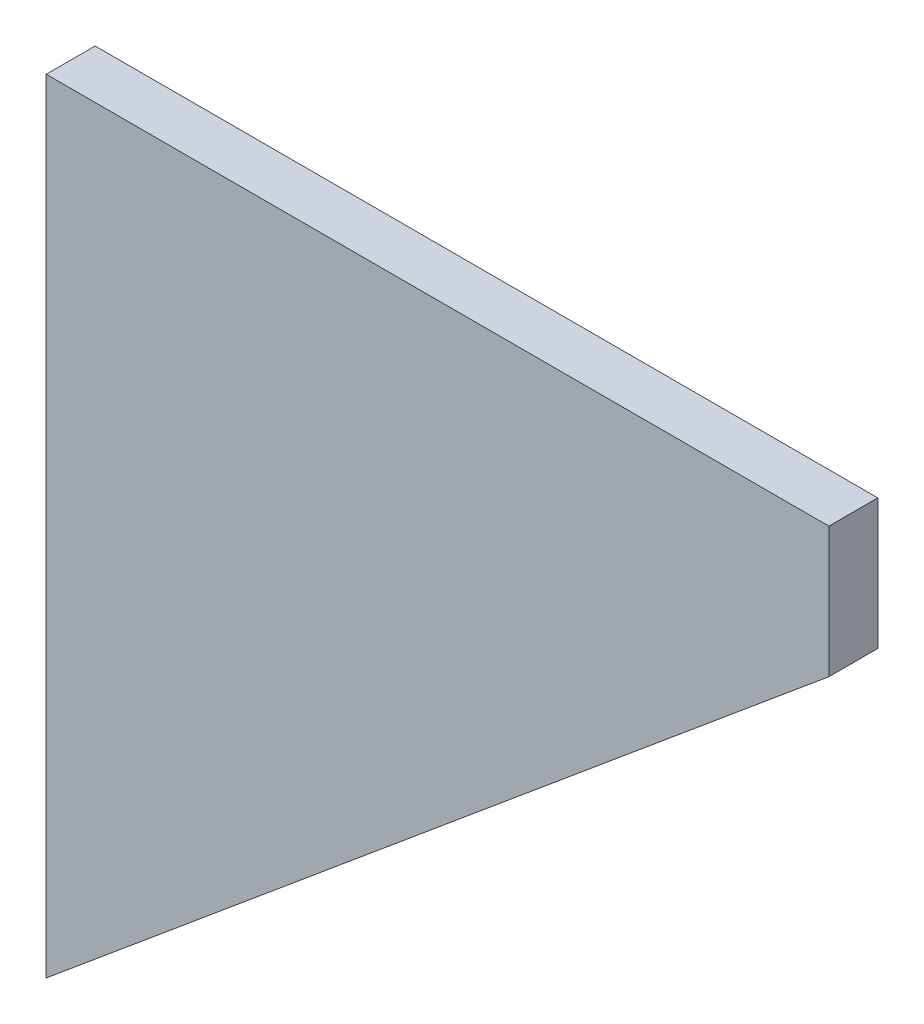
ISO-10303-21;
HEADER;
FILE_DESCRIPTION(('STEP AP214'),'2;1');
FILE_NAME('part.step','',(''),(''),'','','');
FILE_SCHEMA(('AUTOMOTIVE_DESIGN { 1 0 10303 214 1 1 1 1 }'));
ENDSEC;
DATA;
#1=APPLICATION_CONTEXT('core data for automotive mechanical design processes');
#2=APPLICATION_PROTOCOL_DEFINITION('international standard','automotive_design',2000,#1);
#3=PRODUCT_CONTEXT('',#1,'mechanical');
#4=PRODUCT('Part','Part','',(#3));
#5=PRODUCT_RELATED_PRODUCT_CATEGORY('part','',(#4));
#6=PRODUCT_DEFINITION_FORMATION('','',#4);
#7=PRODUCT_DEFINITION_CONTEXT('part definition',#1,'design');
#8=PRODUCT_DEFINITION('design','',#6,#7);
#9=PRODUCT_DEFINITION_SHAPE('','',#8);
#10=(LENGTH_UNIT() NAMED_UNIT(*) SI_UNIT(.MILLI.,.METRE.));
#11=(NAMED_UNIT(*) PLANE_ANGLE_UNIT() SI_UNIT($,.RADIAN.));
#12=(NAMED_UNIT(*) SI_UNIT($,.STERADIAN.) SOLID_ANGLE_UNIT());
#13=UNCERTAINTY_MEASURE_WITH_UNIT(LENGTH_MEASURE(1.E-05),#10,'distance_accuracy_value','');
#14=(GEOMETRIC_REPRESENTATION_CONTEXT(3) GLOBAL_UNCERTAINTY_ASSIGNED_CONTEXT((#13)) GLOBAL_UNIT_ASSIGNED_CONTEXT((#10,
#11,#12)) REPRESENTATION_CONTEXT('',''));
#15=CARTESIAN_POINT('',(0.,0.,0.));
#16=DIRECTION('',(0.,0.,1.));
#17=DIRECTION('',(1.,0.,0.));
#18=AXIS2_PLACEMENT_3D('',#15,#16,#17);
#19=CARTESIAN_POINT('',(0.,0.,9.525));
#20=DIRECTION('',(0.,-1.,0.));
#21=DIRECTION('',(0.,0.,-1.));
#22=AXIS2_PLACEMENT_3D('',#19,#20,#21);
#23=PLANE('',#22);
#24=DIRECTION('',(-1.,0.,0.));
#25=VECTOR('',#24,1.);
#26=CARTESIAN_POINT('',(0.,0.,0.));
#27=LINE('',#26,#25);
#28=CARTESIAN_POINT('',(152.4,0.,0.));
#29=VERTEX_POINT('',#28);
#30=CARTESIAN_POINT('',(0.,0.,0.));
#31=VERTEX_POINT('',#30);
#32=EDGE_CURVE('E70',#29,#31,#27,.T.);
#33=ORIENTED_EDGE('',*,*,#32,.T.);
#34=DIRECTION('',(0.,0.,-1.));
#35=VECTOR('',#34,1.);
#36=CARTESIAN_POINT('',(0.,0.,9.525));
#37=LINE('',#36,#35);
#38=CARTESIAN_POINT('',(0.,0.,9.525));
#39=VERTEX_POINT('',#38);
#40=EDGE_CURVE('E11',#39,#31,#37,.T.);
#41=ORIENTED_EDGE('',*,*,#40,.F.);
#42=DIRECTION('',(-1.,0.,0.));
#43=VECTOR('',#42,1.);
#44=CARTESIAN_POINT('',(0.,0.,9.525));
#45=LINE('',#44,#43);
#46=CARTESIAN_POINT('',(152.4,0.,9.525));
#47=VERTEX_POINT('',#46);
#48=EDGE_CURVE('E88',#47,#39,#45,.T.);
#49=ORIENTED_EDGE('',*,*,#48,.F.);
#50=DIRECTION('',(0.,0.,-1.));
#51=VECTOR('',#50,1.);
#52=CARTESIAN_POINT('',(152.4,0.,9.525));
#53=LINE('',#52,#51);
#54=EDGE_CURVE('E82',#47,#29,#53,.T.);
#55=ORIENTED_EDGE('',*,*,#54,.T.);
#56=EDGE_LOOP('',(#33,#41,#49,#55));
#57=FACE_BOUND('',#56,.T.);
#58=ADVANCED_FACE('F26',(#57),#23,.F.);
#59=CARTESIAN_POINT('',(0.,0.,9.525));
#60=DIRECTION('',(1.,0.,0.));
#61=DIRECTION('',(0.,1.,0.));
#62=AXIS2_PLACEMENT_3D('',#59,#60,#61);
#63=PLANE('',#62);
#64=DIRECTION('',(0.,-1.,0.));
#65=VECTOR('',#64,1.);
#66=CARTESIAN_POINT('',(0.,0.,0.));
#67=LINE('',#66,#65);
#68=CARTESIAN_POINT('',(0.,-152.4,0.));
#69=VERTEX_POINT('',#68);
#70=EDGE_CURVE('E66',#31,#69,#67,.T.);
#71=ORIENTED_EDGE('',*,*,#70,.T.);
#72=DIRECTION('',(0.,0.,-1.));
#73=VECTOR('',#72,1.);
#74=CARTESIAN_POINT('',(0.,-152.4,9.525));
#75=LINE('',#74,#73);
#76=CARTESIAN_POINT('',(0.,-152.4,9.525));
#77=VERTEX_POINT('',#76);
#78=EDGE_CURVE('E33',#77,#69,#75,.T.);
#79=ORIENTED_EDGE('',*,*,#78,.F.);
#80=DIRECTION('',(0.,-1.,0.));
#81=VECTOR('',#80,1.);
#82=CARTESIAN_POINT('',(0.,0.,9.525));
#83=LINE('',#82,#81);
#84=EDGE_CURVE('E78',#39,#77,#83,.T.);
#85=ORIENTED_EDGE('',*,*,#84,.F.);
#86=ORIENTED_EDGE('',*,*,#40,.T.);
#87=EDGE_LOOP('',(#71,#79,#85,#86));
#88=FACE_BOUND('',#87,.T.);
#89=ADVANCED_FACE('F77',(#88),#63,.F.);
#90=CARTESIAN_POINT('',(152.4,-25.4,9.525));
#91=DIRECTION('',(-0.64018439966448,0.768221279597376,0.));
#92=DIRECTION('',(-0.768221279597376,-0.64018439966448,0.));
#93=AXIS2_PLACEMENT_3D('',#90,#91,#92);
#94=PLANE('',#93);
#95=DIRECTION('',(0.768221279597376,0.64018439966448,0.));
#96=VECTOR('',#95,1.);
#97=CARTESIAN_POINT('',(152.4,-25.4,0.));
#98=LINE('',#97,#96);
#99=CARTESIAN_POINT('',(152.4,-25.4,0.));
#100=VERTEX_POINT('',#99);
#101=EDGE_CURVE('E71',#69,#100,#98,.T.);
#102=ORIENTED_EDGE('',*,*,#101,.T.);
#103=DIRECTION('',(0.,0.,-1.));
#104=VECTOR('',#103,1.);
#105=CARTESIAN_POINT('',(152.4,-25.4,9.525));
#106=LINE('',#105,#104);
#107=CARTESIAN_POINT('',(152.4,-25.4,9.525));
#108=VERTEX_POINT('',#107);
#109=EDGE_CURVE('E94',#108,#100,#106,.T.);
#110=ORIENTED_EDGE('',*,*,#109,.F.);
#111=DIRECTION('',(0.768221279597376,0.64018439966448,0.));
#112=VECTOR('',#111,1.);
#113=CARTESIAN_POINT('',(152.4,-25.4,9.525));
#114=LINE('',#113,#112);
#115=EDGE_CURVE('E45',#77,#108,#114,.T.);
#116=ORIENTED_EDGE('',*,*,#115,.F.);
#117=ORIENTED_EDGE('',*,*,#78,.T.);
#118=EDGE_LOOP('',(#102,#110,#116,#117));
#119=FACE_BOUND('',#118,.T.);
#120=ADVANCED_FACE('F97',(#119),#94,.F.);
#121=CARTESIAN_POINT('',(152.4,0.,9.525));
#122=DIRECTION('',(-1.,0.,0.));
#123=DIRECTION('',(0.,0.,1.));
#124=AXIS2_PLACEMENT_3D('',#121,#122,#123);
#125=PLANE('',#124);
#126=DIRECTION('',(0.,1.,0.));
#127=VECTOR('',#126,1.);
#128=CARTESIAN_POINT('',(152.4,0.,0.));
#129=LINE('',#128,#127);
#130=EDGE_CURVE('E86',#100,#29,#129,.T.);
#131=ORIENTED_EDGE('',*,*,#130,.T.);
#132=ORIENTED_EDGE('',*,*,#54,.F.);
#133=DIRECTION('',(0.,1.,0.));
#134=VECTOR('',#133,1.);
#135=CARTESIAN_POINT('',(152.4,0.,9.525));
#136=LINE('',#135,#134);
#137=EDGE_CURVE('E40',#108,#47,#136,.T.);
#138=ORIENTED_EDGE('',*,*,#137,.F.);
#139=ORIENTED_EDGE('',*,*,#109,.T.);
#140=EDGE_LOOP('',(#131,#132,#138,#139));
#141=FACE_BOUND('',#140,.T.);
#142=ADVANCED_FACE('F99',(#141),#125,.F.);
#143=CARTESIAN_POINT('',(152.4,0.,9.525));
#144=DIRECTION('',(0.,0.,-1.));
#145=DIRECTION('',(-1.,0.,0.));
#146=AXIS2_PLACEMENT_3D('',#143,#144,#145);
#147=PLANE('',#146);
#148=ORIENTED_EDGE('',*,*,#48,.T.);
#149=ORIENTED_EDGE('',*,*,#84,.T.);
#150=ORIENTED_EDGE('',*,*,#115,.T.);
#151=ORIENTED_EDGE('',*,*,#137,.T.);
#152=EDGE_LOOP('',(#148,#149,#150,#151));
#153=FACE_BOUND('',#152,.T.);
#154=ADVANCED_FACE('F100',(#153),#147,.F.);
#155=CARTESIAN_POINT('',(152.4,0.,0.));
#156=DIRECTION('',(0.,0.,-1.));
#157=DIRECTION('',(-1.,0.,0.));
#158=AXIS2_PLACEMENT_3D('',#155,#156,#157);
#159=PLANE('',#158);
#160=ORIENTED_EDGE('',*,*,#32,.F.);
#161=ORIENTED_EDGE('',*,*,#130,.F.);
#162=ORIENTED_EDGE('',*,*,#101,.F.);
#163=ORIENTED_EDGE('',*,*,#70,.F.);
#164=EDGE_LOOP('',(#160,#161,#162,#163));
#165=FACE_BOUND('',#164,.T.);
#166=ADVANCED_FACE('F67',(#165),#159,.T.);
#167=CLOSED_SHELL('',(#58,#89,#120,#142,#154,#166));
#168=MANIFOLD_SOLID_BREP('B2',#167);
#169=ADVANCED_BREP_SHAPE_REPRESENTATION('',(#18,#168),#14);
#170=SHAPE_DEFINITION_REPRESENTATION(#9,#169);
ENDSEC;
END-ISO-10303-21;
